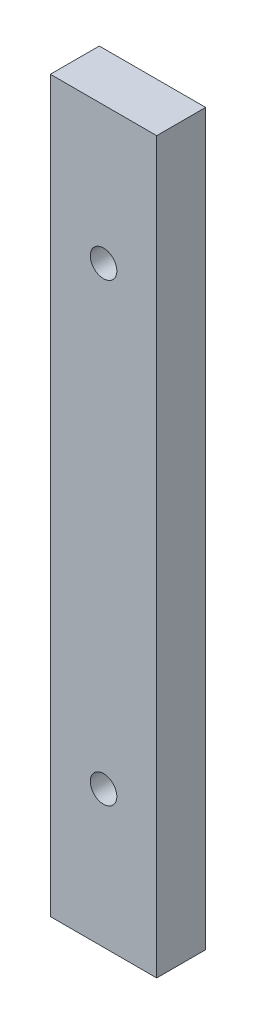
from build123d import *

# Parameters (mm, degrees)
SKICA1_W                = 10
SKICA1_H                = 68.6
SKICA1_R                = 0.5
P_IDAT_VYSUNUT_M1_DEPTH = 4.6
M3_Z_VIT4_D             = 2.5


with BuildPart() as part:
    # Skica1 → P_idat vysunut_m1 (new body)
    with BuildSketch(Plane.XY):
        with Locations((-17.796380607, -15.87745098)):
            Rectangle(SKICA1_W, SKICA1_H)
        with Locations((-17.796380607, 5.52254902)):
            Circle(SKICA1_R, mode=Mode.SUBTRACT)
        with Locations((-17.796380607, -37.27745098)):
            Circle(SKICA1_R, mode=Mode.SUBTRACT)
    extrude(amount=P_IDAT_VYSUNUT_M1_DEPTH)

    # M3 z_vit4 (through all)
    with Locations(Plane.XY.offset(4.6)):
        with Locations((-17.796380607, 5.52254902), (-17.796380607, -37.27745098)):
            Hole(M3_Z_VIT4_D / 2)


solid = part.part
